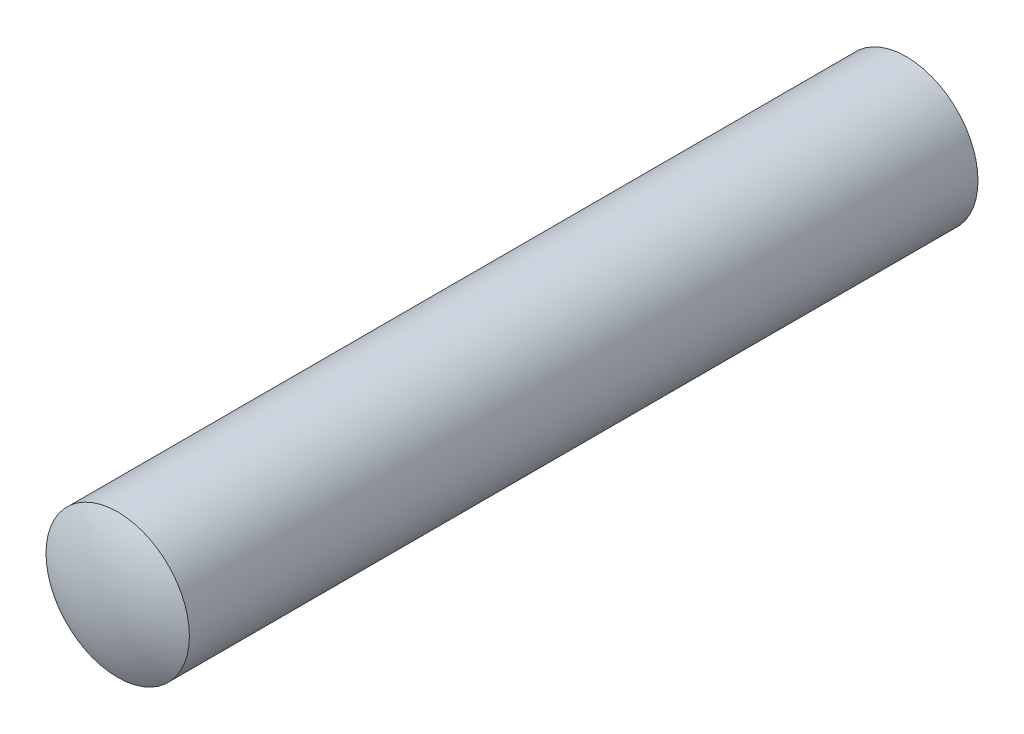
ISO-10303-21;
HEADER;
FILE_DESCRIPTION(('STEP AP214'),'2;1');
FILE_NAME('part.step','',(''),(''),'','','');
FILE_SCHEMA(('AUTOMOTIVE_DESIGN { 1 0 10303 214 1 1 1 1 }'));
ENDSEC;
DATA;
#1=APPLICATION_CONTEXT('core data for automotive mechanical design processes');
#2=APPLICATION_PROTOCOL_DEFINITION('international standard','automotive_design',2000,#1);
#3=PRODUCT_CONTEXT('',#1,'mechanical');
#4=PRODUCT('Part','Part','',(#3));
#5=PRODUCT_RELATED_PRODUCT_CATEGORY('part','',(#4));
#6=PRODUCT_DEFINITION_FORMATION('','',#4);
#7=PRODUCT_DEFINITION_CONTEXT('part definition',#1,'design');
#8=PRODUCT_DEFINITION('design','',#6,#7);
#9=PRODUCT_DEFINITION_SHAPE('','',#8);
#10=(LENGTH_UNIT() NAMED_UNIT(*) SI_UNIT(.MILLI.,.METRE.));
#11=(NAMED_UNIT(*) PLANE_ANGLE_UNIT() SI_UNIT($,.RADIAN.));
#12=(NAMED_UNIT(*) SI_UNIT($,.STERADIAN.) SOLID_ANGLE_UNIT());
#13=UNCERTAINTY_MEASURE_WITH_UNIT(LENGTH_MEASURE(1.E-05),#10,'distance_accuracy_value','');
#14=(GEOMETRIC_REPRESENTATION_CONTEXT(3) GLOBAL_UNCERTAINTY_ASSIGNED_CONTEXT((#13)) GLOBAL_UNIT_ASSIGNED_CONTEXT((#10,
#11,#12)) REPRESENTATION_CONTEXT('',''));
#15=CARTESIAN_POINT('',(0.,0.,0.));
#16=DIRECTION('',(0.,0.,1.));
#17=DIRECTION('',(1.,0.,0.));
#18=AXIS2_PLACEMENT_3D('',#15,#16,#17);
#19=CARTESIAN_POINT('',(0.,0.,22.));
#20=DIRECTION('',(0.,0.,-1.));
#21=DIRECTION('',(-1.,0.,0.));
#22=AXIS2_PLACEMENT_3D('',#19,#20,#21);
#23=CYLINDRICAL_SURFACE('',#22,2.);
#24=CARTESIAN_POINT('',(0.,0.,22.));
#25=DIRECTION('',(0.,0.,1.));
#26=DIRECTION('',(1.,0.,0.));
#27=AXIS2_PLACEMENT_3D('',#24,#25,#26);
#28=CIRCLE('',#27,2.);
#29=CARTESIAN_POINT('',(2.,0.,22.));
#30=VERTEX_POINT('',#29);
#31=EDGE_CURVE('E10',#30,#30,#28,.T.);
#32=ORIENTED_EDGE('',*,*,#31,.F.);
#33=EDGE_LOOP('',(#32));
#34=FACE_BOUND('',#33,.T.);
#35=CARTESIAN_POINT('',(0.,0.,0.));
#36=DIRECTION('',(0.,0.,1.));
#37=DIRECTION('',(1.,0.,0.));
#38=AXIS2_PLACEMENT_3D('',#35,#36,#37);
#39=CIRCLE('',#38,2.);
#40=CARTESIAN_POINT('',(2.,0.,0.));
#41=VERTEX_POINT('',#40);
#42=EDGE_CURVE('E34',#41,#41,#39,.T.);
#43=ORIENTED_EDGE('',*,*,#42,.T.);
#44=EDGE_LOOP('',(#43));
#45=FACE_BOUND('',#44,.T.);
#46=ADVANCED_FACE('F28',(#34,#45),#23,.T.);
#47=CARTESIAN_POINT('',(0.,0.,3.7499999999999));
#48=DIRECTION('',(0.,0.,1.));
#49=DIRECTION('',(-1.,0.,0.));
#50=AXIS2_PLACEMENT_3D('',#47,#48,#49);
#51=SPHERICAL_SURFACE('',#50,4.2499999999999);
#52=ORIENTED_EDGE('',*,*,#42,.F.);
#53=EDGE_LOOP('',(#52));
#54=FACE_BOUND('',#53,.T.);
#55=ADVANCED_FACE('F41',(#54),#51,.T.);
#56=CARTESIAN_POINT('',(0.,0.,18.2500000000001));
#57=DIRECTION('',(0.,0.,-1.));
#58=DIRECTION('',(-1.,0.,0.));
#59=AXIS2_PLACEMENT_3D('',#56,#57,#58);
#60=SPHERICAL_SURFACE('',#59,4.2499999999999);
#61=ORIENTED_EDGE('',*,*,#31,.T.);
#62=EDGE_LOOP('',(#61));
#63=FACE_BOUND('',#62,.T.);
#64=ADVANCED_FACE('F43',(#63),#60,.T.);
#65=CLOSED_SHELL('',(#46,#55,#64));
#66=MANIFOLD_SOLID_BREP('B2',#65);
#67=ADVANCED_BREP_SHAPE_REPRESENTATION('',(#18,#66),#14);
#68=SHAPE_DEFINITION_REPRESENTATION(#9,#67);
ENDSEC;
END-ISO-10303-21;
